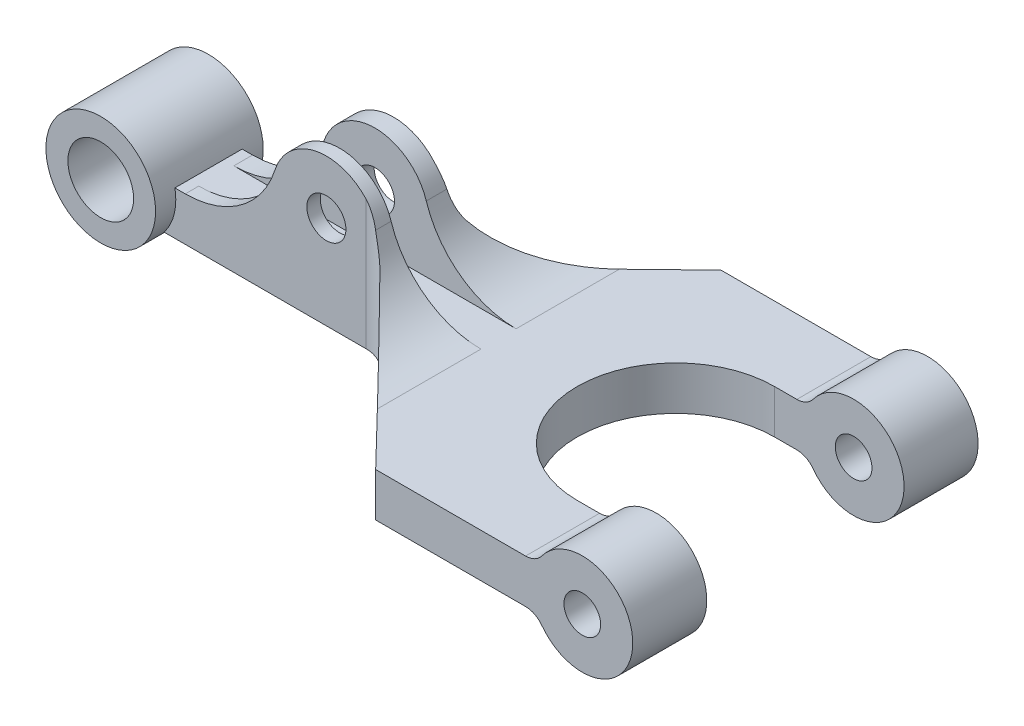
from build123d import *

# Parameters (mm, degrees)
SKETCH1_R           = 8
SKETCH1_R_2         = 2.9
EXTRUDE1_DEPTH      = 10
EXTRUDE2_DEPTH      = 0.5
EXTRUDE2_DEPTH_BACK = 6
SKETCH4_W           = 5.227994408
SKETCH4_H           = 18.151774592
CUT_EXTRUDE1_DEPTH  = 106.350473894
FILLET4_R           = 14
SKETCH6_R           = 7.5
SKETCH6_R_2         = 2.726604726
EXTRUDE4_DEPTH      = 11
EXTRUDE6_DEPTH      = 3
EXTRUDE6_DEPTH_BACK = 13
SKETCH11_R          = 8.15177363
SKETCH11_R_2        = 4.885123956
EXTRUDE7_START      = 11
SKETCH8_R           = 7.5
SKETCH8_R_2         = 2.725
EXTRUDE7_DEPTH      = 11
FILLET19_R          = 3
FILLET23_R          = 5


with BuildPart() as part:
    # Sketch1 → Extrude1 (new body)
    with BuildSketch(Plane.XY):
        with Locations((12.741128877, -63.13435232)):
            Circle(SKETCH1_R)
        with Locations((12.741128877, -63.13435232)):
            Circle(SKETCH1_R_2, mode=Mode.SUBTRACT)
    extrude(amount=-EXTRUDE1_DEPTH)

    # Sketch2 → Extrude2 (add, two sides: drawn at the far end of the back side and taken through both)
    with BuildSketch(Plane(origin=(0, -71, 0), x_dir=(-1, 0, 0), z_dir=(0, 1, 0)).offset(-EXTRUDE2_DEPTH_BACK)):
        with BuildLine():
            Line((-12.741128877, 0), (12.908426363, 0))
            Line((12.908426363, 0), (12.908426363, -10))
            Line((12.908426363, -10), (-12.741128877, -10))
            Line((-12.741128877, -10), (-20.741128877, -10))
            Line((-20.741128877, -10), (-41.392249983, -30))
            Line((-41.392249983, -30), (-65.343112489, -30))
            Line((-65.343112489, -30), (-65.343112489, -19))
            Line((-65.343112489, -19), (-60.343112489, -19))
            ThreePointArc((-60.343112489, -19), (-45.681392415, -4.338279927), (-60.343112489, 10.323440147))
            Line((-60.343112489, 10.323440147), (-65.343112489, 10.323440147))
            Line((-65.343112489, 10.323440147), (-65.343112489, 21.323440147))
            Line((-65.343112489, 21.323440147), (-41.392249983, 21.323440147))
            Line((-41.392249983, 21.323440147), (-20.741128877, 0))
            Line((-20.741128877, 0), (-12.741128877, 0))
        make_face()
    extrude(amount=EXTRUDE2_DEPTH + EXTRUDE2_DEPTH_BACK)

    # Sketch4 → Cut-Extrude1 (cut, through all)
    with BuildSketch(Plane(origin=(0, 0, 0), x_dir=(0, 0, -1), z_dir=(1, 0, 0))):
        with Locations((4.605888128, -61.424112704)):
            Rectangle(SKETCH4_W, SKETCH4_H)
    extrude(amount=CUT_EXTRUDE1_DEPTH, mode=Mode.SUBTRACT)

    # Fillet4
    fillet4_edges = [part.edges().sort_by_distance(p)[0] for p in [
        (9.619072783, -70.5, -0.995945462),
        (15.863184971, -70.5, -8.609942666),
        (15.863184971, -70.5, -0.995945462),
        (9.619072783, -70.5, -8.609942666),
    ]]
    fillet(fillet4_edges, radius=FILLET4_R)

    # Sketch6 → Extrude4 (add)
    with BuildSketch(Plane.XY.offset(21.323440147)):
        with Locations((72.102365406, -73.75)):
            Circle(SKETCH6_R)
        with Locations((72.102365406, -73.75)):
            Circle(SKETCH6_R_2, mode=Mode.SUBTRACT)
    extrude(amount=-EXTRUDE4_DEPTH)

    # Sketch11 → Extrude6 (add, two sides: drawn at the far end of the back side and taken through both)
    with BuildSketch(Plane.XY.offset(-EXTRUDE6_DEPTH_BACK)):
        with Locations((-17.793550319, -71.960171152)):
            Circle(SKETCH11_R)
        with Locations((-17.793550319, -71.960171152)):
            Circle(SKETCH11_R_2, mode=Mode.SUBTRACT)
    extrude(amount=EXTRUDE6_DEPTH + EXTRUDE6_DEPTH_BACK)

    # Sketch8 → Extrude7 (add)
    with BuildSketch(Plane.XY.offset(-30).offset(EXTRUDE7_START)):
        with Locations((72.102365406, -73.75)):
            Circle(SKETCH8_R)
        with Locations((72.102365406, -73.75)):
            Circle(SKETCH8_R_2, mode=Mode.SUBTRACT)
    extrude(amount=-EXTRUDE7_DEPTH)

    # Fillet19
    fillet19_edges = [part.edges().sort_by_distance(p)[0] for p in [
        (65.343112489, -77, 15.823440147),
        (65.343112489, -77, -24.5),
        (65.343112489, -70.5, 15.823440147),
        (65.343112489, -70.5, -24.5),
    ]]
    fillet(fillet19_edges, radius=FILLET19_R)

    # Fillet23
    fillet23_edges = [part.edges().sort_by_distance(p)[0] for p in [
        (20.741128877, -69.378111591, -10),
        (20.741128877, -69.378111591, 0),
    ]]
    fillet(fillet23_edges, radius=FILLET23_R)


solid = part.part
